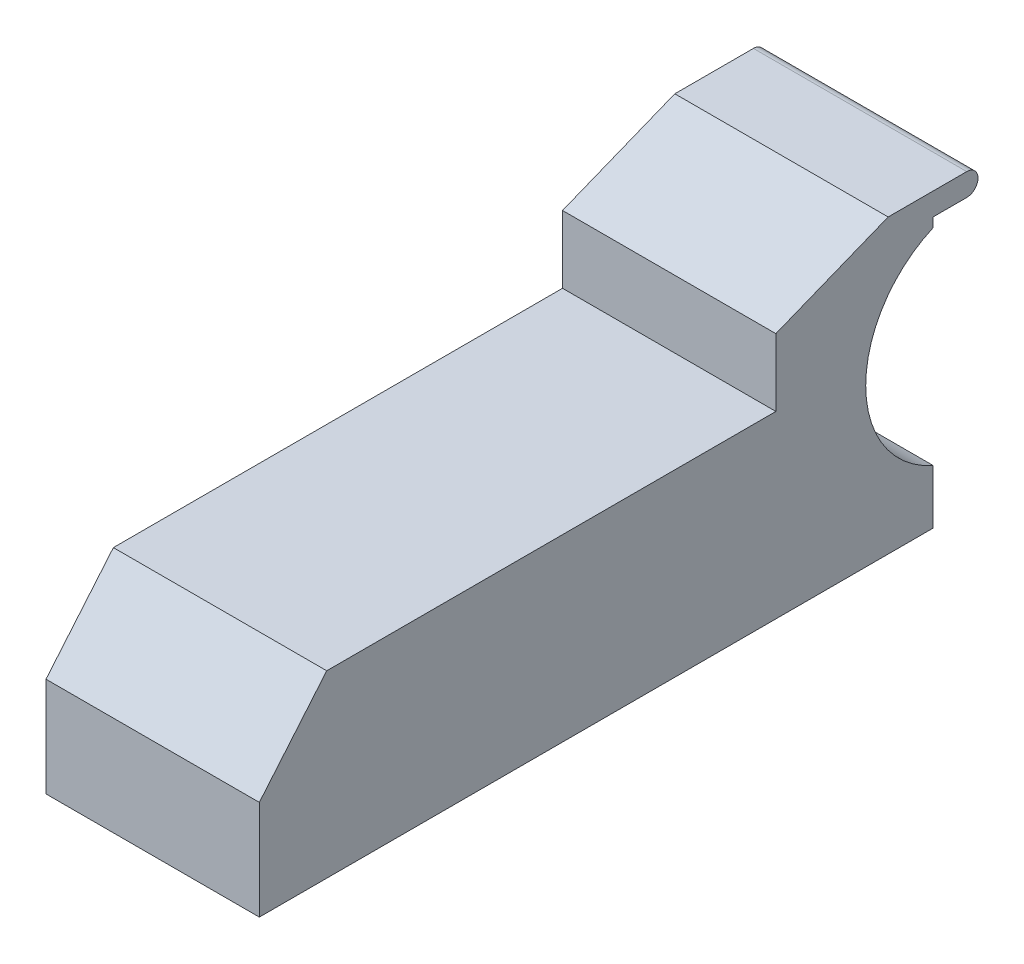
ISO-10303-21;
HEADER;
FILE_DESCRIPTION(('STEP AP214'),'2;1');
FILE_NAME('part.step','',(''),(''),'','','');
FILE_SCHEMA(('AUTOMOTIVE_DESIGN { 1 0 10303 214 1 1 1 1 }'));
ENDSEC;
DATA;
#1=APPLICATION_CONTEXT('core data for automotive mechanical design processes');
#2=APPLICATION_PROTOCOL_DEFINITION('international standard','automotive_design',2000,#1);
#3=PRODUCT_CONTEXT('',#1,'mechanical');
#4=PRODUCT('Part','Part','',(#3));
#5=PRODUCT_RELATED_PRODUCT_CATEGORY('part','',(#4));
#6=PRODUCT_DEFINITION_FORMATION('','',#4);
#7=PRODUCT_DEFINITION_CONTEXT('part definition',#1,'design');
#8=PRODUCT_DEFINITION('design','',#6,#7);
#9=PRODUCT_DEFINITION_SHAPE('','',#8);
#10=(LENGTH_UNIT() NAMED_UNIT(*) SI_UNIT(.MILLI.,.METRE.));
#11=(NAMED_UNIT(*) PLANE_ANGLE_UNIT() SI_UNIT($,.RADIAN.));
#12=(NAMED_UNIT(*) SI_UNIT($,.STERADIAN.) SOLID_ANGLE_UNIT());
#13=UNCERTAINTY_MEASURE_WITH_UNIT(LENGTH_MEASURE(1.E-05),#10,'distance_accuracy_value','');
#14=(GEOMETRIC_REPRESENTATION_CONTEXT(3) GLOBAL_UNCERTAINTY_ASSIGNED_CONTEXT((#13)) GLOBAL_UNIT_ASSIGNED_CONTEXT((#10,
#11,#12)) REPRESENTATION_CONTEXT('',''));
#15=CARTESIAN_POINT('',(0.,0.,0.));
#16=DIRECTION('',(0.,0.,1.));
#17=DIRECTION('',(1.,0.,0.));
#18=AXIS2_PLACEMENT_3D('',#15,#16,#17);
#19=CARTESIAN_POINT('',(0.,0.,32.));
#20=DIRECTION('',(1.,0.,0.));
#21=DIRECTION('',(0.,0.,-1.));
#22=AXIS2_PLACEMENT_3D('',#19,#20,#21);
#23=PLANE('',#22);
#24=DIRECTION('',(0.,-0.766044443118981,0.642787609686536));
#25=VECTOR('',#24,1.);
#26=CARTESIAN_POINT('',(0.,1.82819565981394,34.1787587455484));
#27=LINE('',#26,#25);
#28=CARTESIAN_POINT('',(0.,8.,29.));
#29=VERTEX_POINT('',#28);
#30=CARTESIAN_POINT('',(0.,4.42473922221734,32.));
#31=VERTEX_POINT('',#30);
#32=EDGE_CURVE('E231',#29,#31,#27,.T.);
#33=ORIENTED_EDGE('',*,*,#32,.F.);
#34=DIRECTION('',(0.,0.,1.));
#35=VECTOR('',#34,1.);
#36=CARTESIAN_POINT('',(0.,8.,32.));
#37=LINE('',#36,#35);
#38=CARTESIAN_POINT('',(0.,8.,9.));
#39=VERTEX_POINT('',#38);
#40=EDGE_CURVE('E239',#39,#29,#37,.T.);
#41=ORIENTED_EDGE('',*,*,#40,.F.);
#42=DIRECTION('',(0.,-1.,0.));
#43=VECTOR('',#42,1.);
#44=CARTESIAN_POINT('',(0.,0.,9.));
#45=LINE('',#44,#43);
#46=CARTESIAN_POINT('',(0.,10.9999999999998,9.));
#47=VERTEX_POINT('',#46);
#48=EDGE_CURVE('E237',#47,#39,#45,.T.);
#49=ORIENTED_EDGE('',*,*,#48,.F.);
#50=DIRECTION('',(0.,-0.37139067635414,0.928476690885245));
#51=VECTOR('',#50,1.);
#52=CARTESIAN_POINT('',(0.,1.55172413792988,32.620689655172));
#53=LINE('',#52,#51);
#54=CARTESIAN_POINT('',(0.,13.,4.));
#55=VERTEX_POINT('',#54);
#56=EDGE_CURVE('E233',#55,#47,#53,.T.);
#57=ORIENTED_EDGE('',*,*,#56,.F.);
#58=DIRECTION('',(0.,0.,-1.));
#59=VECTOR('',#58,1.);
#60=CARTESIAN_POINT('',(0.,13.,32.));
#61=LINE('',#60,#59);
#62=CARTESIAN_POINT('',(0.,13.,0.5));
#63=VERTEX_POINT('',#62);
#64=EDGE_CURVE('E254',#55,#63,#61,.T.);
#65=ORIENTED_EDGE('',*,*,#64,.T.);
#66=CARTESIAN_POINT('',(0.,12.5,0.5));
#67=DIRECTION('',(1.,0.,0.));
#68=DIRECTION('',(0.,0.,-1.));
#69=AXIS2_PLACEMENT_3D('',#66,#67,#68);
#70=CIRCLE('',#69,0.5);
#71=CARTESIAN_POINT('',(0.,12.,0.5));
#72=VERTEX_POINT('',#71);
#73=EDGE_CURVE('E55',#72,#63,#70,.T.);
#74=ORIENTED_EDGE('',*,*,#73,.F.);
#75=DIRECTION('',(0.,0.,-1.));
#76=VECTOR('',#75,1.);
#77=CARTESIAN_POINT('',(0.,12.,32.));
#78=LINE('',#77,#76);
#79=CARTESIAN_POINT('',(0.,12.,2.));
#80=VERTEX_POINT('',#79);
#81=EDGE_CURVE('E235',#80,#72,#78,.T.);
#82=ORIENTED_EDGE('',*,*,#81,.F.);
#83=DIRECTION('',(0.,1.,4.55369566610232E-12));
#84=VECTOR('',#83,1.);
#85=CARTESIAN_POINT('',(0.,1.36610869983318E-10,1.99999999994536));
#86=LINE('',#85,#84);
#87=CARTESIAN_POINT('',(0.,11.5825756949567,1.9999999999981));
#88=VERTEX_POINT('',#87);
#89=EDGE_CURVE('E245',#88,#80,#86,.T.);
#90=ORIENTED_EDGE('',*,*,#89,.F.);
#91=CARTESIAN_POINT('',(0.,7.,0.));
#92=DIRECTION('',(1.,0.,0.));
#93=DIRECTION('',(0.,0.,-1.));
#94=AXIS2_PLACEMENT_3D('',#91,#92,#93);
#95=CIRCLE('',#94,5.);
#96=CARTESIAN_POINT('',(0.,2.41742430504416,2.));
#97=VERTEX_POINT('',#96);
#98=EDGE_CURVE('E243',#97,#88,#95,.F.);
#99=ORIENTED_EDGE('',*,*,#98,.F.);
#100=DIRECTION('',(0.,1.,0.));
#101=VECTOR('',#100,1.);
#102=CARTESIAN_POINT('',(0.,0.,2.));
#103=LINE('',#102,#101);
#104=CARTESIAN_POINT('',(0.,0.,2.));
#105=VERTEX_POINT('',#104);
#106=EDGE_CURVE('E241',#105,#97,#103,.T.);
#107=ORIENTED_EDGE('',*,*,#106,.F.);
#108=DIRECTION('',(0.,0.,-1.));
#109=VECTOR('',#108,1.);
#110=CARTESIAN_POINT('',(0.,0.,32.));
#111=LINE('',#110,#109);
#112=CARTESIAN_POINT('',(0.,0.,32.));
#113=VERTEX_POINT('',#112);
#114=EDGE_CURVE('E263',#113,#105,#111,.T.);
#115=ORIENTED_EDGE('',*,*,#114,.F.);
#116=DIRECTION('',(0.,-1.,0.));
#117=VECTOR('',#116,1.);
#118=CARTESIAN_POINT('',(0.,0.,32.));
#119=LINE('',#118,#117);
#120=EDGE_CURVE('E247',#31,#113,#119,.T.);
#121=ORIENTED_EDGE('',*,*,#120,.F.);
#122=EDGE_LOOP('',(#33,#41,#49,#57,#65,#74,#82,#90,#99,#107,#115,#121));
#123=FACE_BOUND('',#122,.T.);
#124=ADVANCED_FACE('F33',(#123),#23,.F.);
#125=CARTESIAN_POINT('',(0.,0.,32.));
#126=DIRECTION('',(0.,1.,0.));
#127=DIRECTION('',(0.,0.,1.));
#128=AXIS2_PLACEMENT_3D('',#125,#126,#127);
#129=PLANE('',#128);
#130=DIRECTION('',(0.,0.,-1.));
#131=VECTOR('',#130,1.);
#132=CARTESIAN_POINT('',(2.73921735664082,0.,26.5));
#133=LINE('',#132,#131);
#134=CARTESIAN_POINT('',(2.73921735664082,0.,26.5));
#135=VERTEX_POINT('',#134);
#136=CARTESIAN_POINT('',(2.73921735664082,0.,10.5));
#137=VERTEX_POINT('',#136);
#138=EDGE_CURVE('E174',#135,#137,#133,.T.);
#139=ORIENTED_EDGE('',*,*,#138,.F.);
#140=CARTESIAN_POINT('',(4.75,0.,26.5));
#141=DIRECTION('',(0.,-1.,0.));
#142=DIRECTION('',(0.,0.,-1.));
#143=AXIS2_PLACEMENT_3D('',#140,#141,#142);
#144=CIRCLE('',#143,2.01078264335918);
#145=CARTESIAN_POINT('',(6.76078264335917,0.,26.5));
#146=VERTEX_POINT('',#145);
#147=EDGE_CURVE('E47',#146,#135,#144,.T.);
#148=ORIENTED_EDGE('',*,*,#147,.F.);
#149=DIRECTION('',(0.,0.,1.));
#150=VECTOR('',#149,1.);
#151=CARTESIAN_POINT('',(6.76078264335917,0.,26.5));
#152=LINE('',#151,#150);
#153=CARTESIAN_POINT('',(6.76078264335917,0.,10.5));
#154=VERTEX_POINT('',#153);
#155=EDGE_CURVE('E165',#154,#146,#152,.T.);
#156=ORIENTED_EDGE('',*,*,#155,.F.);
#157=CARTESIAN_POINT('',(4.75,0.,10.5));
#158=DIRECTION('',(0.,-1.,0.));
#159=DIRECTION('',(0.,0.,-1.));
#160=AXIS2_PLACEMENT_3D('',#157,#158,#159);
#161=CIRCLE('',#160,2.01078264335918);
#162=EDGE_CURVE('E168',#137,#154,#161,.T.);
#163=ORIENTED_EDGE('',*,*,#162,.F.);
#164=EDGE_LOOP('',(#139,#148,#156,#163));
#165=FACE_BOUND('',#164,.T.);
#166=DIRECTION('',(1.,0.,0.));
#167=VECTOR('',#166,1.);
#168=CARTESIAN_POINT('',(-22.5,0.,2.));
#169=LINE('',#168,#167);
#170=CARTESIAN_POINT('',(9.5,0.,2.));
#171=VERTEX_POINT('',#170);
#172=EDGE_CURVE('E215',#105,#171,#169,.T.);
#173=ORIENTED_EDGE('',*,*,#172,.T.);
#174=DIRECTION('',(0.,0.,-1.));
#175=VECTOR('',#174,1.);
#176=CARTESIAN_POINT('',(9.5,0.,32.));
#177=LINE('',#176,#175);
#178=CARTESIAN_POINT('',(9.5,0.,32.));
#179=VERTEX_POINT('',#178);
#180=EDGE_CURVE('E260',#179,#171,#177,.T.);
#181=ORIENTED_EDGE('',*,*,#180,.F.);
#182=DIRECTION('',(1.,0.,0.));
#183=VECTOR('',#182,1.);
#184=CARTESIAN_POINT('',(0.,0.,32.));
#185=LINE('',#184,#183);
#186=EDGE_CURVE('E249',#113,#179,#185,.T.);
#187=ORIENTED_EDGE('',*,*,#186,.F.);
#188=ORIENTED_EDGE('',*,*,#114,.T.);
#189=EDGE_LOOP('',(#173,#181,#187,#188));
#190=FACE_BOUND('',#189,.T.);
#191=ADVANCED_FACE('F282',(#165,#190),#129,.F.);
#192=CARTESIAN_POINT('',(9.5,0.,32.));
#193=DIRECTION('',(-1.,0.,0.));
#194=DIRECTION('',(0.,0.,1.));
#195=AXIS2_PLACEMENT_3D('',#192,#193,#194);
#196=PLANE('',#195);
#197=DIRECTION('',(0.,-0.766044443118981,0.642787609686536));
#198=VECTOR('',#197,1.);
#199=CARTESIAN_POINT('',(9.5,4.42473922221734,32.));
#200=LINE('',#199,#198);
#201=CARTESIAN_POINT('',(9.5,8.,29.));
#202=VERTEX_POINT('',#201);
#203=CARTESIAN_POINT('',(9.5,4.42473922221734,32.));
#204=VERTEX_POINT('',#203);
#205=EDGE_CURVE('E201',#202,#204,#200,.T.);
#206=ORIENTED_EDGE('',*,*,#205,.T.);
#207=DIRECTION('',(0.,1.,0.));
#208=VECTOR('',#207,1.);
#209=CARTESIAN_POINT('',(9.5,0.,32.));
#210=LINE('',#209,#208);
#211=EDGE_CURVE('E251',#179,#204,#210,.T.);
#212=ORIENTED_EDGE('',*,*,#211,.F.);
#213=ORIENTED_EDGE('',*,*,#180,.T.);
#214=DIRECTION('',(0.,1.,0.));
#215=VECTOR('',#214,1.);
#216=CARTESIAN_POINT('',(9.5,0.,2.));
#217=LINE('',#216,#215);
#218=CARTESIAN_POINT('',(9.5,2.41742430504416,2.));
#219=VERTEX_POINT('',#218);
#220=EDGE_CURVE('E204',#171,#219,#217,.T.);
#221=ORIENTED_EDGE('',*,*,#220,.T.);
#222=CARTESIAN_POINT('',(9.5,7.,0.));
#223=DIRECTION('',(-1.,0.,0.));
#224=DIRECTION('',(0.,0.,-1.));
#225=AXIS2_PLACEMENT_3D('',#222,#223,#224);
#226=CIRCLE('',#225,5.);
#227=CARTESIAN_POINT('',(9.5,11.5825756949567,1.9999999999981));
#228=VERTEX_POINT('',#227);
#229=EDGE_CURVE('E207',#219,#228,#226,.T.);
#230=ORIENTED_EDGE('',*,*,#229,.T.);
#231=DIRECTION('',(0.,1.,4.55369566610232E-12));
#232=VECTOR('',#231,1.);
#233=CARTESIAN_POINT('',(9.5,11.5825756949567,1.9999999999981));
#234=LINE('',#233,#232);
#235=CARTESIAN_POINT('',(9.5,12.,2.));
#236=VERTEX_POINT('',#235);
#237=EDGE_CURVE('E180',#228,#236,#234,.T.);
#238=ORIENTED_EDGE('',*,*,#237,.T.);
#239=DIRECTION('',(0.,0.,-1.));
#240=VECTOR('',#239,1.);
#241=CARTESIAN_POINT('',(9.5,12.,2.));
#242=LINE('',#241,#240);
#243=CARTESIAN_POINT('',(9.5,12.,0.5));
#244=VERTEX_POINT('',#243);
#245=EDGE_CURVE('E186',#236,#244,#242,.T.);
#246=ORIENTED_EDGE('',*,*,#245,.T.);
#247=CARTESIAN_POINT('',(9.5,12.5,0.5));
#248=DIRECTION('',(1.,0.,0.));
#249=DIRECTION('',(0.,0.,-1.));
#250=AXIS2_PLACEMENT_3D('',#247,#248,#249);
#251=CIRCLE('',#250,0.5);
#252=CARTESIAN_POINT('',(9.5,13.,0.5));
#253=VERTEX_POINT('',#252);
#254=EDGE_CURVE('E189',#244,#253,#251,.T.);
#255=ORIENTED_EDGE('',*,*,#254,.T.);
#256=DIRECTION('',(0.,0.,-1.));
#257=VECTOR('',#256,1.);
#258=CARTESIAN_POINT('',(9.5,13.,32.));
#259=LINE('',#258,#257);
#260=CARTESIAN_POINT('',(9.5,13.,4.));
#261=VERTEX_POINT('',#260);
#262=EDGE_CURVE('E257',#261,#253,#259,.T.);
#263=ORIENTED_EDGE('',*,*,#262,.F.);
#264=DIRECTION('',(0.,-0.37139067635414,0.928476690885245));
#265=VECTOR('',#264,1.);
#266=CARTESIAN_POINT('',(9.5,13.,4.));
#267=LINE('',#266,#265);
#268=CARTESIAN_POINT('',(9.5,10.9999999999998,9.));
#269=VERTEX_POINT('',#268);
#270=EDGE_CURVE('E192',#261,#269,#267,.T.);
#271=ORIENTED_EDGE('',*,*,#270,.T.);
#272=DIRECTION('',(0.,-1.,0.));
#273=VECTOR('',#272,1.);
#274=CARTESIAN_POINT('',(9.5,8.,9.));
#275=LINE('',#274,#273);
#276=CARTESIAN_POINT('',(9.5,8.,9.));
#277=VERTEX_POINT('',#276);
#278=EDGE_CURVE('E195',#269,#277,#275,.T.);
#279=ORIENTED_EDGE('',*,*,#278,.T.);
#280=DIRECTION('',(0.,0.,1.));
#281=VECTOR('',#280,1.);
#282=CARTESIAN_POINT('',(9.5,8.,29.));
#283=LINE('',#282,#281);
#284=EDGE_CURVE('E198',#277,#202,#283,.T.);
#285=ORIENTED_EDGE('',*,*,#284,.T.);
#286=EDGE_LOOP('',(#206,#212,#213,#221,#230,#238,#246,#255,#263,#271,#279,#285));
#287=FACE_BOUND('',#286,.T.);
#288=ADVANCED_FACE('F275',(#287),#196,.F.);
#289=CARTESIAN_POINT('',(0.,13.,32.));
#290=DIRECTION('',(0.,-1.,0.));
#291=DIRECTION('',(0.,0.,-1.));
#292=AXIS2_PLACEMENT_3D('',#289,#290,#291);
#293=PLANE('',#292);
#294=DIRECTION('',(-1.,0.,0.));
#295=VECTOR('',#294,1.);
#296=CARTESIAN_POINT('',(0.,13.,4.));
#297=LINE('',#296,#295);
#298=EDGE_CURVE('E12',#261,#55,#297,.T.);
#299=ORIENTED_EDGE('',*,*,#298,.F.);
#300=ORIENTED_EDGE('',*,*,#262,.T.);
#301=DIRECTION('',(1.,0.,0.));
#302=VECTOR('',#301,1.);
#303=CARTESIAN_POINT('',(-22.5,13.,0.5));
#304=LINE('',#303,#302);
#305=EDGE_CURVE('E224',#63,#253,#304,.T.);
#306=ORIENTED_EDGE('',*,*,#305,.F.);
#307=ORIENTED_EDGE('',*,*,#64,.F.);
#308=EDGE_LOOP('',(#299,#300,#306,#307));
#309=FACE_BOUND('',#308,.T.);
#310=ADVANCED_FACE('F309',(#309),#293,.F.);
#311=CARTESIAN_POINT('',(0.,13.,32.));
#312=DIRECTION('',(0.,0.,-1.));
#313=DIRECTION('',(-1.,0.,0.));
#314=AXIS2_PLACEMENT_3D('',#311,#312,#313);
#315=PLANE('',#314);
#316=DIRECTION('',(1.,0.,0.));
#317=VECTOR('',#316,1.);
#318=CARTESIAN_POINT('',(0.,4.42473922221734,32.));
#319=LINE('',#318,#317);
#320=EDGE_CURVE('E40',#31,#204,#319,.T.);
#321=ORIENTED_EDGE('',*,*,#320,.F.);
#322=ORIENTED_EDGE('',*,*,#120,.T.);
#323=ORIENTED_EDGE('',*,*,#186,.T.);
#324=ORIENTED_EDGE('',*,*,#211,.T.);
#325=EDGE_LOOP('',(#321,#322,#323,#324));
#326=FACE_BOUND('',#325,.T.);
#327=ADVANCED_FACE('F277',(#326),#315,.F.);
#328=CARTESIAN_POINT('',(-22.5,4.42473922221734,32.));
#329=DIRECTION('',(0.,0.642787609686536,0.766044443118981));
#330=DIRECTION('',(0.,-0.766044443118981,0.642787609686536));
#331=AXIS2_PLACEMENT_3D('',#328,#329,#330);
#332=PLANE('',#331);
#333=ORIENTED_EDGE('',*,*,#32,.T.);
#334=ORIENTED_EDGE('',*,*,#320,.T.);
#335=ORIENTED_EDGE('',*,*,#205,.F.);
#336=DIRECTION('',(1.,0.,0.));
#337=VECTOR('',#336,1.);
#338=CARTESIAN_POINT('',(-22.5,8.,29.));
#339=LINE('',#338,#337);
#340=EDGE_CURVE('E218',#29,#202,#339,.T.);
#341=ORIENTED_EDGE('',*,*,#340,.F.);
#342=EDGE_LOOP('',(#333,#334,#335,#341));
#343=FACE_BOUND('',#342,.T.);
#344=ADVANCED_FACE('F268',(#343),#332,.T.);
#345=CARTESIAN_POINT('',(-22.5,13.,4.));
#346=DIRECTION('',(0.,0.928476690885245,0.37139067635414));
#347=DIRECTION('',(0.,-0.37139067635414,0.928476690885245));
#348=AXIS2_PLACEMENT_3D('',#345,#346,#347);
#349=PLANE('',#348);
#350=ORIENTED_EDGE('',*,*,#56,.T.);
#351=DIRECTION('',(1.,0.,0.));
#352=VECTOR('',#351,1.);
#353=CARTESIAN_POINT('',(-22.5,10.9999999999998,9.));
#354=LINE('',#353,#352);
#355=EDGE_CURVE('E222',#47,#269,#354,.T.);
#356=ORIENTED_EDGE('',*,*,#355,.T.);
#357=ORIENTED_EDGE('',*,*,#270,.F.);
#358=ORIENTED_EDGE('',*,*,#298,.T.);
#359=EDGE_LOOP('',(#350,#356,#357,#358));
#360=FACE_BOUND('',#359,.T.);
#361=ADVANCED_FACE('F312',(#360),#349,.T.);
#362=CARTESIAN_POINT('',(-22.5,8.,9.));
#363=DIRECTION('',(0.,0.,1.));
#364=DIRECTION('',(1.,0.,0.));
#365=AXIS2_PLACEMENT_3D('',#362,#363,#364);
#366=PLANE('',#365);
#367=ORIENTED_EDGE('',*,*,#48,.T.);
#368=DIRECTION('',(1.,0.,0.));
#369=VECTOR('',#368,1.);
#370=CARTESIAN_POINT('',(-22.5,8.,9.));
#371=LINE('',#370,#369);
#372=EDGE_CURVE('E220',#39,#277,#371,.T.);
#373=ORIENTED_EDGE('',*,*,#372,.T.);
#374=ORIENTED_EDGE('',*,*,#278,.F.);
#375=ORIENTED_EDGE('',*,*,#355,.F.);
#376=EDGE_LOOP('',(#367,#373,#374,#375));
#377=FACE_BOUND('',#376,.T.);
#378=ADVANCED_FACE('F315',(#377),#366,.T.);
#379=CARTESIAN_POINT('',(-22.5,8.,29.));
#380=DIRECTION('',(0.,1.,0.));
#381=DIRECTION('',(0.,0.,1.));
#382=AXIS2_PLACEMENT_3D('',#379,#380,#381);
#383=PLANE('',#382);
#384=ORIENTED_EDGE('',*,*,#40,.T.);
#385=ORIENTED_EDGE('',*,*,#340,.T.);
#386=ORIENTED_EDGE('',*,*,#284,.F.);
#387=ORIENTED_EDGE('',*,*,#372,.F.);
#388=EDGE_LOOP('',(#384,#385,#386,#387));
#389=FACE_BOUND('',#388,.T.);
#390=ADVANCED_FACE('F319',(#389),#383,.T.);
#391=CARTESIAN_POINT('',(-22.5,11.5825756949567,1.9999999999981));
#392=DIRECTION('',(0.,4.55369566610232E-12,-1.));
#393=DIRECTION('',(0.,1.,4.55369566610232E-12));
#394=AXIS2_PLACEMENT_3D('',#391,#392,#393);
#395=PLANE('',#394);
#396=ORIENTED_EDGE('',*,*,#89,.T.);
#397=DIRECTION('',(1.,0.,0.));
#398=VECTOR('',#397,1.);
#399=CARTESIAN_POINT('',(-22.5,12.,2.));
#400=LINE('',#399,#398);
#401=EDGE_CURVE('E210',#80,#236,#400,.T.);
#402=ORIENTED_EDGE('',*,*,#401,.T.);
#403=ORIENTED_EDGE('',*,*,#237,.F.);
#404=DIRECTION('',(1.,0.,0.));
#405=VECTOR('',#404,1.);
#406=CARTESIAN_POINT('',(-22.5,11.5825756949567,1.9999999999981));
#407=LINE('',#406,#405);
#408=EDGE_CURVE('E211',#88,#228,#407,.T.);
#409=ORIENTED_EDGE('',*,*,#408,.F.);
#410=EDGE_LOOP('',(#396,#402,#403,#409));
#411=FACE_BOUND('',#410,.T.);
#412=ADVANCED_FACE('F295',(#411),#395,.T.);
#413=CARTESIAN_POINT('',(-22.5,7.,0.));
#414=DIRECTION('',(1.,0.,0.));
#415=DIRECTION('',(0.,0.,-1.));
#416=AXIS2_PLACEMENT_3D('',#413,#414,#415);
#417=CYLINDRICAL_SURFACE('',#416,5.);
#418=ORIENTED_EDGE('',*,*,#98,.T.);
#419=ORIENTED_EDGE('',*,*,#408,.T.);
#420=ORIENTED_EDGE('',*,*,#229,.F.);
#421=DIRECTION('',(1.,0.,0.));
#422=VECTOR('',#421,1.);
#423=CARTESIAN_POINT('',(-22.5,2.41742430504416,2.));
#424=LINE('',#423,#422);
#425=EDGE_CURVE('E213',#97,#219,#424,.T.);
#426=ORIENTED_EDGE('',*,*,#425,.F.);
#427=EDGE_LOOP('',(#418,#419,#420,#426));
#428=FACE_BOUND('',#427,.T.);
#429=ADVANCED_FACE('F290',(#428),#417,.F.);
#430=CARTESIAN_POINT('',(-22.5,0.,2.));
#431=DIRECTION('',(0.,0.,-1.));
#432=DIRECTION('',(-1.,0.,0.));
#433=AXIS2_PLACEMENT_3D('',#430,#431,#432);
#434=PLANE('',#433);
#435=ORIENTED_EDGE('',*,*,#106,.T.);
#436=ORIENTED_EDGE('',*,*,#425,.T.);
#437=ORIENTED_EDGE('',*,*,#220,.F.);
#438=ORIENTED_EDGE('',*,*,#172,.F.);
#439=EDGE_LOOP('',(#435,#436,#437,#438));
#440=FACE_BOUND('',#439,.T.);
#441=ADVANCED_FACE('F285',(#440),#434,.T.);
#442=CARTESIAN_POINT('',(-22.5,12.,2.));
#443=DIRECTION('',(0.,-1.,0.));
#444=DIRECTION('',(0.,0.,-1.));
#445=AXIS2_PLACEMENT_3D('',#442,#443,#444);
#446=PLANE('',#445);
#447=ORIENTED_EDGE('',*,*,#81,.T.);
#448=DIRECTION('',(1.,0.,0.));
#449=VECTOR('',#448,1.);
#450=CARTESIAN_POINT('',(-22.5,12.,0.5));
#451=LINE('',#450,#449);
#452=EDGE_CURVE('E226',#72,#244,#451,.T.);
#453=ORIENTED_EDGE('',*,*,#452,.T.);
#454=ORIENTED_EDGE('',*,*,#245,.F.);
#455=ORIENTED_EDGE('',*,*,#401,.F.);
#456=EDGE_LOOP('',(#447,#453,#454,#455));
#457=FACE_BOUND('',#456,.T.);
#458=ADVANCED_FACE('F300',(#457),#446,.T.);
#459=CARTESIAN_POINT('',(-22.5,12.5,0.5));
#460=DIRECTION('',(1.,0.,0.));
#461=DIRECTION('',(0.,0.,-1.));
#462=AXIS2_PLACEMENT_3D('',#459,#460,#461);
#463=CYLINDRICAL_SURFACE('',#462,0.5);
#464=ORIENTED_EDGE('',*,*,#73,.T.);
#465=ORIENTED_EDGE('',*,*,#305,.T.);
#466=ORIENTED_EDGE('',*,*,#254,.F.);
#467=ORIENTED_EDGE('',*,*,#452,.F.);
#468=EDGE_LOOP('',(#464,#465,#466,#467));
#469=FACE_BOUND('',#468,.T.);
#470=ADVANCED_FACE('F302',(#469),#463,.T.);
#471=CARTESIAN_POINT('',(4.75,4.,26.5));
#472=DIRECTION('',(0.,-1.,0.));
#473=DIRECTION('',(0.,0.,-1.));
#474=AXIS2_PLACEMENT_3D('',#471,#472,#473);
#475=CYLINDRICAL_SURFACE('',#474,2.01078264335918);
#476=ORIENTED_EDGE('',*,*,#147,.T.);
#477=DIRECTION('',(0.,-1.,0.));
#478=VECTOR('',#477,1.);
#479=CARTESIAN_POINT('',(2.73921735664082,4.,26.5));
#480=LINE('',#479,#478);
#481=CARTESIAN_POINT('',(2.73921735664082,4.,26.5));
#482=VERTEX_POINT('',#481);
#483=EDGE_CURVE('E143',#482,#135,#480,.T.);
#484=ORIENTED_EDGE('',*,*,#483,.F.);
#485=CARTESIAN_POINT('',(4.75,4.,26.5));
#486=DIRECTION('',(0.,-1.,0.));
#487=DIRECTION('',(0.,0.,-1.));
#488=AXIS2_PLACEMENT_3D('',#485,#486,#487);
#489=CIRCLE('',#488,2.01078264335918);
#490=CARTESIAN_POINT('',(6.76078264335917,4.,26.5));
#491=VERTEX_POINT('',#490);
#492=EDGE_CURVE('E147',#491,#482,#489,.T.);
#493=ORIENTED_EDGE('',*,*,#492,.F.);
#494=DIRECTION('',(0.,-1.,0.));
#495=VECTOR('',#494,1.);
#496=CARTESIAN_POINT('',(6.76078264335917,4.,26.5));
#497=LINE('',#496,#495);
#498=EDGE_CURVE('E178',#491,#146,#497,.T.);
#499=ORIENTED_EDGE('',*,*,#498,.T.);
#500=EDGE_LOOP('',(#476,#484,#493,#499));
#501=FACE_BOUND('',#500,.T.);
#502=ADVANCED_FACE('F145',(#501),#475,.F.);
#503=CARTESIAN_POINT('',(6.76078264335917,4.,26.5));
#504=DIRECTION('',(1.,0.,0.));
#505=DIRECTION('',(0.,0.,-1.));
#506=AXIS2_PLACEMENT_3D('',#503,#504,#505);
#507=PLANE('',#506);
#508=ORIENTED_EDGE('',*,*,#155,.T.);
#509=ORIENTED_EDGE('',*,*,#498,.F.);
#510=DIRECTION('',(0.,0.,1.));
#511=VECTOR('',#510,1.);
#512=CARTESIAN_POINT('',(6.76078264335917,4.,26.5));
#513=LINE('',#512,#511);
#514=CARTESIAN_POINT('',(6.76078264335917,4.,10.5));
#515=VERTEX_POINT('',#514);
#516=EDGE_CURVE('E153',#515,#491,#513,.T.);
#517=ORIENTED_EDGE('',*,*,#516,.F.);
#518=DIRECTION('',(0.,-1.,0.));
#519=VECTOR('',#518,1.);
#520=CARTESIAN_POINT('',(6.76078264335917,4.,10.5));
#521=LINE('',#520,#519);
#522=EDGE_CURVE('E181',#515,#154,#521,.T.);
#523=ORIENTED_EDGE('',*,*,#522,.T.);
#524=EDGE_LOOP('',(#508,#509,#517,#523));
#525=FACE_BOUND('',#524,.T.);
#526=ADVANCED_FACE('F360',(#525),#507,.F.);
#527=CARTESIAN_POINT('',(4.75,4.,10.5));
#528=DIRECTION('',(0.,-1.,0.));
#529=DIRECTION('',(0.,0.,-1.));
#530=AXIS2_PLACEMENT_3D('',#527,#528,#529);
#531=CYLINDRICAL_SURFACE('',#530,2.01078264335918);
#532=ORIENTED_EDGE('',*,*,#162,.T.);
#533=ORIENTED_EDGE('',*,*,#522,.F.);
#534=CARTESIAN_POINT('',(4.75,4.,10.5));
#535=DIRECTION('',(0.,-1.,0.));
#536=DIRECTION('',(0.,0.,-1.));
#537=AXIS2_PLACEMENT_3D('',#534,#535,#536);
#538=CIRCLE('',#537,2.01078264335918);
#539=CARTESIAN_POINT('',(2.73921735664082,4.,10.5));
#540=VERTEX_POINT('',#539);
#541=EDGE_CURVE('E161',#540,#515,#538,.T.);
#542=ORIENTED_EDGE('',*,*,#541,.F.);
#543=DIRECTION('',(0.,-1.,0.));
#544=VECTOR('',#543,1.);
#545=CARTESIAN_POINT('',(2.73921735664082,4.,10.5));
#546=LINE('',#545,#544);
#547=EDGE_CURVE('E152',#540,#137,#546,.T.);
#548=ORIENTED_EDGE('',*,*,#547,.T.);
#549=EDGE_LOOP('',(#532,#533,#542,#548));
#550=FACE_BOUND('',#549,.T.);
#551=ADVANCED_FACE('F363',(#550),#531,.F.);
#552=CARTESIAN_POINT('',(2.73921735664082,4.,26.5));
#553=DIRECTION('',(-1.,0.,0.));
#554=DIRECTION('',(0.,0.,1.));
#555=AXIS2_PLACEMENT_3D('',#552,#553,#554);
#556=PLANE('',#555);
#557=ORIENTED_EDGE('',*,*,#138,.T.);
#558=ORIENTED_EDGE('',*,*,#547,.F.);
#559=DIRECTION('',(0.,0.,-1.));
#560=VECTOR('',#559,1.);
#561=CARTESIAN_POINT('',(2.73921735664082,4.,26.5));
#562=LINE('',#561,#560);
#563=EDGE_CURVE('E156',#482,#540,#562,.T.);
#564=ORIENTED_EDGE('',*,*,#563,.F.);
#565=ORIENTED_EDGE('',*,*,#483,.T.);
#566=EDGE_LOOP('',(#557,#558,#564,#565));
#567=FACE_BOUND('',#566,.T.);
#568=ADVANCED_FACE('F157',(#567),#556,.F.);
#569=CARTESIAN_POINT('',(4.75,4.,26.5));
#570=DIRECTION('',(0.,-1.,0.));
#571=DIRECTION('',(0.,0.,-1.));
#572=AXIS2_PLACEMENT_3D('',#569,#570,#571);
#573=PLANE('',#572);
#574=ORIENTED_EDGE('',*,*,#492,.T.);
#575=ORIENTED_EDGE('',*,*,#563,.T.);
#576=ORIENTED_EDGE('',*,*,#541,.T.);
#577=ORIENTED_EDGE('',*,*,#516,.T.);
#578=EDGE_LOOP('',(#574,#575,#576,#577));
#579=FACE_BOUND('',#578,.T.);
#580=ADVANCED_FACE('F163',(#579),#573,.T.);
#581=CLOSED_SHELL('',(#124,#191,#288,#310,#327,#344,#361,#378,#390,#412,#429,#441,#458,#470,
#502,#526,#551,#568,#580));
#582=MANIFOLD_SOLID_BREP('B2',#581);
#583=ADVANCED_BREP_SHAPE_REPRESENTATION('',(#18,#582),#14);
#584=SHAPE_DEFINITION_REPRESENTATION(#9,#583);
ENDSEC;
END-ISO-10303-21;
